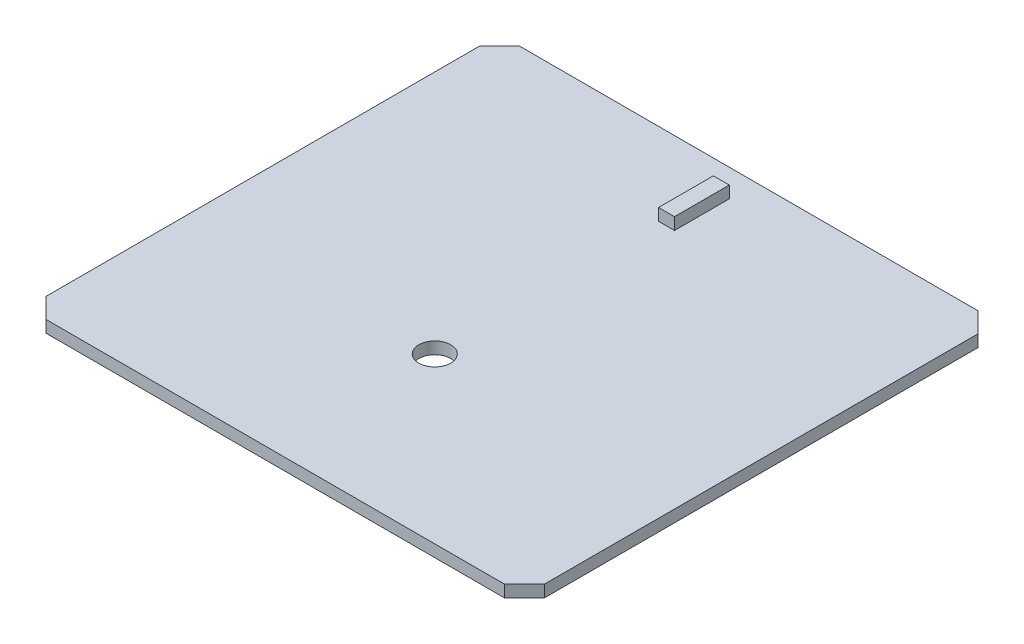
ISO-10303-21;
HEADER;
FILE_DESCRIPTION(('STEP AP214'),'2;1');
FILE_NAME('part.step','',(''),(''),'','','');
FILE_SCHEMA(('AUTOMOTIVE_DESIGN { 1 0 10303 214 1 1 1 1 }'));
ENDSEC;
DATA;
#1=APPLICATION_CONTEXT('core data for automotive mechanical design processes');
#2=APPLICATION_PROTOCOL_DEFINITION('international standard','automotive_design',2000,#1);
#3=PRODUCT_CONTEXT('',#1,'mechanical');
#4=PRODUCT('Part','Part','',(#3));
#5=PRODUCT_RELATED_PRODUCT_CATEGORY('part','',(#4));
#6=PRODUCT_DEFINITION_FORMATION('','',#4);
#7=PRODUCT_DEFINITION_CONTEXT('part definition',#1,'design');
#8=PRODUCT_DEFINITION('design','',#6,#7);
#9=PRODUCT_DEFINITION_SHAPE('','',#8);
#10=(LENGTH_UNIT() NAMED_UNIT(*) SI_UNIT(.MILLI.,.METRE.));
#11=(NAMED_UNIT(*) PLANE_ANGLE_UNIT() SI_UNIT($,.RADIAN.));
#12=(NAMED_UNIT(*) SI_UNIT($,.STERADIAN.) SOLID_ANGLE_UNIT());
#13=UNCERTAINTY_MEASURE_WITH_UNIT(LENGTH_MEASURE(1.E-05),#10,'distance_accuracy_value','');
#14=(GEOMETRIC_REPRESENTATION_CONTEXT(3) GLOBAL_UNCERTAINTY_ASSIGNED_CONTEXT((#13)) GLOBAL_UNIT_ASSIGNED_CONTEXT((#10,
#11,#12)) REPRESENTATION_CONTEXT('',''));
#15=CARTESIAN_POINT('',(0.,0.,0.));
#16=DIRECTION('',(0.,0.,1.));
#17=DIRECTION('',(1.,0.,0.));
#18=AXIS2_PLACEMENT_3D('',#15,#16,#17);
#19=CARTESIAN_POINT('',(0.,0.,0.));
#20=DIRECTION('',(0.,-1.,0.));
#21=DIRECTION('',(0.,0.,-1.));
#22=AXIS2_PLACEMENT_3D('',#19,#20,#21);
#23=PLANE('',#22);
#24=DIRECTION('',(-1.,0.,0.));
#25=VECTOR('',#24,1.);
#26=CARTESIAN_POINT('',(23.,0.,-23.75));
#27=LINE('',#26,#25);
#28=CARTESIAN_POINT('',(23.,0.,-23.75));
#29=VERTEX_POINT('',#28);
#30=CARTESIAN_POINT('',(-23.,0.,-23.75));
#31=VERTEX_POINT('',#30);
#32=EDGE_CURVE('E212',#29,#31,#27,.T.);
#33=ORIENTED_EDGE('',*,*,#32,.F.);
#34=DIRECTION('',(-0.707106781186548,0.,-0.707106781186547));
#35=VECTOR('',#34,1.);
#36=CARTESIAN_POINT('',(25.,0.,-21.75));
#37=LINE('',#36,#35);
#38=CARTESIAN_POINT('',(25.,0.,-21.75));
#39=VERTEX_POINT('',#38);
#40=EDGE_CURVE('E219',#39,#29,#37,.T.);
#41=ORIENTED_EDGE('',*,*,#40,.F.);
#42=DIRECTION('',(0.,0.,-1.));
#43=VECTOR('',#42,1.);
#44=CARTESIAN_POINT('',(25.,0.,21.75));
#45=LINE('',#44,#43);
#46=CARTESIAN_POINT('',(25.,0.,21.75));
#47=VERTEX_POINT('',#46);
#48=EDGE_CURVE('E246',#47,#39,#45,.T.);
#49=ORIENTED_EDGE('',*,*,#48,.F.);
#50=DIRECTION('',(0.707106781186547,0.,-0.707106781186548));
#51=VECTOR('',#50,1.);
#52=CARTESIAN_POINT('',(25.,0.,21.75));
#53=LINE('',#52,#51);
#54=CARTESIAN_POINT('',(23.,0.,23.75));
#55=VERTEX_POINT('',#54);
#56=EDGE_CURVE('E244',#55,#47,#53,.T.);
#57=ORIENTED_EDGE('',*,*,#56,.F.);
#58=DIRECTION('',(1.,0.,0.));
#59=VECTOR('',#58,1.);
#60=CARTESIAN_POINT('',(23.,0.,23.75));
#61=LINE('',#60,#59);
#62=CARTESIAN_POINT('',(-23.,0.,23.75));
#63=VERTEX_POINT('',#62);
#64=EDGE_CURVE('E242',#63,#55,#61,.T.);
#65=ORIENTED_EDGE('',*,*,#64,.F.);
#66=DIRECTION('',(0.707106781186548,0.,0.707106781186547));
#67=VECTOR('',#66,1.);
#68=CARTESIAN_POINT('',(-23.,0.,23.75));
#69=LINE('',#68,#67);
#70=CARTESIAN_POINT('',(-25.,0.,21.75));
#71=VERTEX_POINT('',#70);
#72=EDGE_CURVE('E240',#71,#63,#69,.T.);
#73=ORIENTED_EDGE('',*,*,#72,.F.);
#74=DIRECTION('',(0.,0.,1.));
#75=VECTOR('',#74,1.);
#76=CARTESIAN_POINT('',(-25.,0.,21.75));
#77=LINE('',#76,#75);
#78=CARTESIAN_POINT('',(-25.,0.,-21.75));
#79=VERTEX_POINT('',#78);
#80=EDGE_CURVE('E238',#79,#71,#77,.T.);
#81=ORIENTED_EDGE('',*,*,#80,.F.);
#82=DIRECTION('',(-0.707106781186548,0.,0.707106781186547));
#83=VECTOR('',#82,1.);
#84=CARTESIAN_POINT('',(-23.,0.,-23.75));
#85=LINE('',#84,#83);
#86=EDGE_CURVE('E236',#31,#79,#85,.T.);
#87=ORIENTED_EDGE('',*,*,#86,.F.);
#88=EDGE_LOOP('',(#33,#41,#49,#57,#65,#73,#81,#87));
#89=FACE_BOUND('',#88,.T.);
#90=CARTESIAN_POINT('',(-0.500000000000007,0.,7.25));
#91=DIRECTION('',(0.,1.,0.));
#92=DIRECTION('',(0.,0.,1.));
#93=AXIS2_PLACEMENT_3D('',#90,#91,#92);
#94=CIRCLE('',#93,1.6);
#95=CARTESIAN_POINT('',(-0.500000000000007,0.,8.85));
#96=VERTEX_POINT('',#95);
#97=EDGE_CURVE('E208',#96,#96,#94,.T.);
#98=ORIENTED_EDGE('',*,*,#97,.T.);
#99=EDGE_LOOP('',(#98));
#100=FACE_BOUND('',#99,.T.);
#101=DIRECTION('',(1.,0.,0.));
#102=VECTOR('',#101,1.);
#103=CARTESIAN_POINT('',(-8.50000000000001,0.,9.));
#104=LINE('',#103,#102);
#105=CARTESIAN_POINT('',(-15.5,0.,9.));
#106=VERTEX_POINT('',#105);
#107=CARTESIAN_POINT('',(-8.50000000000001,0.,9.));
#108=VERTEX_POINT('',#107);
#109=EDGE_CURVE('E497',#106,#108,#104,.T.);
#110=ORIENTED_EDGE('',*,*,#109,.F.);
#111=DIRECTION('',(0.,0.,-1.));
#112=VECTOR('',#111,1.);
#113=CARTESIAN_POINT('',(-15.5,0.,13.5));
#114=LINE('',#113,#112);
#115=CARTESIAN_POINT('',(-15.5,0.,13.5));
#116=VERTEX_POINT('',#115);
#117=EDGE_CURVE('E172',#116,#106,#114,.T.);
#118=ORIENTED_EDGE('',*,*,#117,.F.);
#119=DIRECTION('',(-1.,0.,0.));
#120=VECTOR('',#119,1.);
#121=CARTESIAN_POINT('',(-8.50000000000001,0.,13.5));
#122=LINE('',#121,#120);
#123=CARTESIAN_POINT('',(-8.50000000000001,0.,13.5));
#124=VERTEX_POINT('',#123);
#125=EDGE_CURVE('E168',#124,#116,#122,.T.);
#126=ORIENTED_EDGE('',*,*,#125,.F.);
#127=DIRECTION('',(0.,0.,1.));
#128=VECTOR('',#127,1.);
#129=CARTESIAN_POINT('',(-8.50000000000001,0.,13.5));
#130=LINE('',#129,#128);
#131=EDGE_CURVE('E494',#108,#124,#130,.T.);
#132=ORIENTED_EDGE('',*,*,#131,.F.);
#133=EDGE_LOOP('',(#110,#118,#126,#132));
#134=FACE_BOUND('',#133,.T.);
#135=ADVANCED_FACE('F36',(#89,#100,#134),#23,.T.);
#136=CARTESIAN_POINT('',(0.,1.2,0.));
#137=DIRECTION('',(0.,-1.,0.));
#138=DIRECTION('',(0.,0.,-1.));
#139=AXIS2_PLACEMENT_3D('',#136,#137,#138);
#140=PLANE('',#139);
#141=CARTESIAN_POINT('',(-0.500000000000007,1.2,7.25));
#142=DIRECTION('',(0.,1.,0.));
#143=DIRECTION('',(0.,0.,1.));
#144=AXIS2_PLACEMENT_3D('',#141,#142,#143);
#145=CIRCLE('',#144,1.6);
#146=CARTESIAN_POINT('',(-0.500000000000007,1.2,8.85));
#147=VERTEX_POINT('',#146);
#148=EDGE_CURVE('E209',#147,#147,#145,.T.);
#149=ORIENTED_EDGE('',*,*,#148,.F.);
#150=EDGE_LOOP('',(#149));
#151=FACE_BOUND('',#150,.T.);
#152=DIRECTION('',(-1.,0.,0.));
#153=VECTOR('',#152,1.);
#154=CARTESIAN_POINT('',(23.,1.2,-23.75));
#155=LINE('',#154,#153);
#156=CARTESIAN_POINT('',(23.,1.2,-23.75));
#157=VERTEX_POINT('',#156);
#158=CARTESIAN_POINT('',(-23.,1.2,-23.75));
#159=VERTEX_POINT('',#158);
#160=EDGE_CURVE('E215',#157,#159,#155,.T.);
#161=ORIENTED_EDGE('',*,*,#160,.T.);
#162=DIRECTION('',(-0.707106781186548,0.,0.707106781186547));
#163=VECTOR('',#162,1.);
#164=CARTESIAN_POINT('',(-23.,1.2,-23.75));
#165=LINE('',#164,#163);
#166=CARTESIAN_POINT('',(-25.,1.2,-21.75));
#167=VERTEX_POINT('',#166);
#168=EDGE_CURVE('E218',#159,#167,#165,.T.);
#169=ORIENTED_EDGE('',*,*,#168,.T.);
#170=DIRECTION('',(0.,0.,1.));
#171=VECTOR('',#170,1.);
#172=CARTESIAN_POINT('',(-25.,1.2,21.75));
#173=LINE('',#172,#171);
#174=CARTESIAN_POINT('',(-25.,1.2,21.75));
#175=VERTEX_POINT('',#174);
#176=EDGE_CURVE('E221',#167,#175,#173,.T.);
#177=ORIENTED_EDGE('',*,*,#176,.T.);
#178=DIRECTION('',(0.707106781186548,0.,0.707106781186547));
#179=VECTOR('',#178,1.);
#180=CARTESIAN_POINT('',(-23.,1.2,23.75));
#181=LINE('',#180,#179);
#182=CARTESIAN_POINT('',(-23.,1.2,23.75));
#183=VERTEX_POINT('',#182);
#184=EDGE_CURVE('E223',#175,#183,#181,.T.);
#185=ORIENTED_EDGE('',*,*,#184,.T.);
#186=DIRECTION('',(1.,0.,0.));
#187=VECTOR('',#186,1.);
#188=CARTESIAN_POINT('',(23.,1.2,23.75));
#189=LINE('',#188,#187);
#190=CARTESIAN_POINT('',(23.,1.2,23.75));
#191=VERTEX_POINT('',#190);
#192=EDGE_CURVE('E225',#183,#191,#189,.T.);
#193=ORIENTED_EDGE('',*,*,#192,.T.);
#194=DIRECTION('',(0.707106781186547,0.,-0.707106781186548));
#195=VECTOR('',#194,1.);
#196=CARTESIAN_POINT('',(25.,1.2,21.75));
#197=LINE('',#196,#195);
#198=CARTESIAN_POINT('',(25.,1.2,21.75));
#199=VERTEX_POINT('',#198);
#200=EDGE_CURVE('E227',#191,#199,#197,.T.);
#201=ORIENTED_EDGE('',*,*,#200,.T.);
#202=DIRECTION('',(0.,0.,-1.));
#203=VECTOR('',#202,1.);
#204=CARTESIAN_POINT('',(25.,1.2,21.75));
#205=LINE('',#204,#203);
#206=CARTESIAN_POINT('',(25.,1.2,-21.75));
#207=VERTEX_POINT('',#206);
#208=EDGE_CURVE('E229',#199,#207,#205,.T.);
#209=ORIENTED_EDGE('',*,*,#208,.T.);
#210=DIRECTION('',(-0.707106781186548,0.,-0.707106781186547));
#211=VECTOR('',#210,1.);
#212=CARTESIAN_POINT('',(25.,1.2,-21.75));
#213=LINE('',#212,#211);
#214=EDGE_CURVE('E231',#207,#157,#213,.T.);
#215=ORIENTED_EDGE('',*,*,#214,.T.);
#216=EDGE_LOOP('',(#161,#169,#177,#185,#193,#201,#209,#215));
#217=FACE_BOUND('',#216,.T.);
#218=DIRECTION('',(0.,0.,-1.));
#219=VECTOR('',#218,1.);
#220=CARTESIAN_POINT('',(0.799999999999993,1.2,-15.5));
#221=LINE('',#220,#219);
#222=CARTESIAN_POINT('',(0.799999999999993,1.2,-15.5));
#223=VERTEX_POINT('',#222);
#224=CARTESIAN_POINT('',(0.799999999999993,1.2,-21.));
#225=VERTEX_POINT('',#224);
#226=EDGE_CURVE('E174',#223,#225,#221,.T.);
#227=ORIENTED_EDGE('',*,*,#226,.F.);
#228=DIRECTION('',(1.,0.,0.));
#229=VECTOR('',#228,1.);
#230=CARTESIAN_POINT('',(-0.800000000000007,1.2,-15.5));
#231=LINE('',#230,#229);
#232=CARTESIAN_POINT('',(-0.800000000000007,1.2,-15.5));
#233=VERTEX_POINT('',#232);
#234=EDGE_CURVE('E185',#233,#223,#231,.T.);
#235=ORIENTED_EDGE('',*,*,#234,.F.);
#236=DIRECTION('',(0.,0.,1.));
#237=VECTOR('',#236,1.);
#238=CARTESIAN_POINT('',(-0.800000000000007,1.2,-15.5));
#239=LINE('',#238,#237);
#240=CARTESIAN_POINT('',(-0.800000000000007,1.2,-21.));
#241=VERTEX_POINT('',#240);
#242=EDGE_CURVE('E193',#241,#233,#239,.T.);
#243=ORIENTED_EDGE('',*,*,#242,.F.);
#244=DIRECTION('',(-1.,0.,0.));
#245=VECTOR('',#244,1.);
#246=CARTESIAN_POINT('',(-0.800000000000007,1.2,-21.));
#247=LINE('',#246,#245);
#248=EDGE_CURVE('E59',#225,#241,#247,.T.);
#249=ORIENTED_EDGE('',*,*,#248,.F.);
#250=EDGE_LOOP('',(#227,#235,#243,#249));
#251=FACE_BOUND('',#250,.T.);
#252=ADVANCED_FACE('F289',(#151,#217,#251),#140,.F.);
#253=CARTESIAN_POINT('',(23.,1.2,-23.75));
#254=DIRECTION('',(0.,0.,1.));
#255=DIRECTION('',(1.,0.,0.));
#256=AXIS2_PLACEMENT_3D('',#253,#254,#255);
#257=PLANE('',#256);
#258=ORIENTED_EDGE('',*,*,#32,.T.);
#259=DIRECTION('',(0.,-1.,0.));
#260=VECTOR('',#259,1.);
#261=CARTESIAN_POINT('',(-23.,1.2,-23.75));
#262=LINE('',#261,#260);
#263=EDGE_CURVE('E11',#159,#31,#262,.T.);
#264=ORIENTED_EDGE('',*,*,#263,.F.);
#265=ORIENTED_EDGE('',*,*,#160,.F.);
#266=DIRECTION('',(0.,-1.,0.));
#267=VECTOR('',#266,1.);
#268=CARTESIAN_POINT('',(23.,1.2,-23.75));
#269=LINE('',#268,#267);
#270=EDGE_CURVE('E233',#157,#29,#269,.T.);
#271=ORIENTED_EDGE('',*,*,#270,.T.);
#272=EDGE_LOOP('',(#258,#264,#265,#271));
#273=FACE_BOUND('',#272,.T.);
#274=ADVANCED_FACE('F38',(#273),#257,.F.);
#275=CARTESIAN_POINT('',(-23.,1.2,-23.75));
#276=DIRECTION('',(0.707106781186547,0.,0.707106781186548));
#277=DIRECTION('',(0.707106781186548,0.,-0.707106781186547));
#278=AXIS2_PLACEMENT_3D('',#275,#276,#277);
#279=PLANE('',#278);
#280=ORIENTED_EDGE('',*,*,#86,.T.);
#281=DIRECTION('',(0.,-1.,0.));
#282=VECTOR('',#281,1.);
#283=CARTESIAN_POINT('',(-25.,1.2,-21.75));
#284=LINE('',#283,#282);
#285=EDGE_CURVE('E44',#167,#79,#284,.T.);
#286=ORIENTED_EDGE('',*,*,#285,.F.);
#287=ORIENTED_EDGE('',*,*,#168,.F.);
#288=ORIENTED_EDGE('',*,*,#263,.T.);
#289=EDGE_LOOP('',(#280,#286,#287,#288));
#290=FACE_BOUND('',#289,.T.);
#291=ADVANCED_FACE('F293',(#290),#279,.F.);
#292=CARTESIAN_POINT('',(-25.,1.2,21.75));
#293=DIRECTION('',(1.,0.,0.));
#294=DIRECTION('',(0.,0.,-1.));
#295=AXIS2_PLACEMENT_3D('',#292,#293,#294);
#296=PLANE('',#295);
#297=ORIENTED_EDGE('',*,*,#80,.T.);
#298=DIRECTION('',(0.,-1.,0.));
#299=VECTOR('',#298,1.);
#300=CARTESIAN_POINT('',(-25.,1.2,21.75));
#301=LINE('',#300,#299);
#302=EDGE_CURVE('E263',#175,#71,#301,.T.);
#303=ORIENTED_EDGE('',*,*,#302,.F.);
#304=ORIENTED_EDGE('',*,*,#176,.F.);
#305=ORIENTED_EDGE('',*,*,#285,.T.);
#306=EDGE_LOOP('',(#297,#303,#304,#305));
#307=FACE_BOUND('',#306,.T.);
#308=ADVANCED_FACE('F270',(#307),#296,.F.);
#309=CARTESIAN_POINT('',(-23.,1.2,23.75));
#310=DIRECTION('',(0.707106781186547,0.,-0.707106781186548));
#311=DIRECTION('',(-0.707106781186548,0.,-0.707106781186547));
#312=AXIS2_PLACEMENT_3D('',#309,#310,#311);
#313=PLANE('',#312);
#314=ORIENTED_EDGE('',*,*,#72,.T.);
#315=DIRECTION('',(0.,-1.,0.));
#316=VECTOR('',#315,1.);
#317=CARTESIAN_POINT('',(-23.,1.2,23.75));
#318=LINE('',#317,#316);
#319=EDGE_CURVE('E260',#183,#63,#318,.T.);
#320=ORIENTED_EDGE('',*,*,#319,.F.);
#321=ORIENTED_EDGE('',*,*,#184,.F.);
#322=ORIENTED_EDGE('',*,*,#302,.T.);
#323=EDGE_LOOP('',(#314,#320,#321,#322));
#324=FACE_BOUND('',#323,.T.);
#325=ADVANCED_FACE('F281',(#324),#313,.F.);
#326=CARTESIAN_POINT('',(23.,1.2,23.75));
#327=DIRECTION('',(0.,0.,-1.));
#328=DIRECTION('',(-1.,0.,0.));
#329=AXIS2_PLACEMENT_3D('',#326,#327,#328);
#330=PLANE('',#329);
#331=ORIENTED_EDGE('',*,*,#64,.T.);
#332=DIRECTION('',(0.,-1.,0.));
#333=VECTOR('',#332,1.);
#334=CARTESIAN_POINT('',(23.,1.2,23.75));
#335=LINE('',#334,#333);
#336=EDGE_CURVE('E257',#191,#55,#335,.T.);
#337=ORIENTED_EDGE('',*,*,#336,.F.);
#338=ORIENTED_EDGE('',*,*,#192,.F.);
#339=ORIENTED_EDGE('',*,*,#319,.T.);
#340=EDGE_LOOP('',(#331,#337,#338,#339));
#341=FACE_BOUND('',#340,.T.);
#342=ADVANCED_FACE('F285',(#341),#330,.F.);
#343=CARTESIAN_POINT('',(25.,1.2,21.75));
#344=DIRECTION('',(-0.707106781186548,0.,-0.707106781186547));
#345=DIRECTION('',(-0.707106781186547,0.,0.707106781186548));
#346=AXIS2_PLACEMENT_3D('',#343,#344,#345);
#347=PLANE('',#346);
#348=ORIENTED_EDGE('',*,*,#56,.T.);
#349=DIRECTION('',(0.,-1.,0.));
#350=VECTOR('',#349,1.);
#351=CARTESIAN_POINT('',(25.,1.2,21.75));
#352=LINE('',#351,#350);
#353=EDGE_CURVE('E254',#199,#47,#352,.T.);
#354=ORIENTED_EDGE('',*,*,#353,.F.);
#355=ORIENTED_EDGE('',*,*,#200,.F.);
#356=ORIENTED_EDGE('',*,*,#336,.T.);
#357=EDGE_LOOP('',(#348,#354,#355,#356));
#358=FACE_BOUND('',#357,.T.);
#359=ADVANCED_FACE('F306',(#358),#347,.F.);
#360=CARTESIAN_POINT('',(25.,1.2,21.75));
#361=DIRECTION('',(-1.,0.,0.));
#362=DIRECTION('',(0.,0.,1.));
#363=AXIS2_PLACEMENT_3D('',#360,#361,#362);
#364=PLANE('',#363);
#365=ORIENTED_EDGE('',*,*,#48,.T.);
#366=DIRECTION('',(0.,-1.,0.));
#367=VECTOR('',#366,1.);
#368=CARTESIAN_POINT('',(25.,1.2,-21.75));
#369=LINE('',#368,#367);
#370=EDGE_CURVE('E251',#207,#39,#369,.T.);
#371=ORIENTED_EDGE('',*,*,#370,.F.);
#372=ORIENTED_EDGE('',*,*,#208,.F.);
#373=ORIENTED_EDGE('',*,*,#353,.T.);
#374=EDGE_LOOP('',(#365,#371,#372,#373));
#375=FACE_BOUND('',#374,.T.);
#376=ADVANCED_FACE('F304',(#375),#364,.F.);
#377=CARTESIAN_POINT('',(25.,1.2,-21.75));
#378=DIRECTION('',(-0.707106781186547,0.,0.707106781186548));
#379=DIRECTION('',(0.707106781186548,0.,0.707106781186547));
#380=AXIS2_PLACEMENT_3D('',#377,#378,#379);
#381=PLANE('',#380);
#382=ORIENTED_EDGE('',*,*,#40,.T.);
#383=ORIENTED_EDGE('',*,*,#270,.F.);
#384=ORIENTED_EDGE('',*,*,#214,.F.);
#385=ORIENTED_EDGE('',*,*,#370,.T.);
#386=EDGE_LOOP('',(#382,#383,#384,#385));
#387=FACE_BOUND('',#386,.T.);
#388=ADVANCED_FACE('F299',(#387),#381,.F.);
#389=CARTESIAN_POINT('',(-0.500000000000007,1.2,7.25));
#390=DIRECTION('',(0.,-1.,0.));
#391=DIRECTION('',(0.,0.,-1.));
#392=AXIS2_PLACEMENT_3D('',#389,#390,#391);
#393=CYLINDRICAL_SURFACE('',#392,1.6);
#394=ORIENTED_EDGE('',*,*,#148,.T.);
#395=EDGE_LOOP('',(#394));
#396=FACE_BOUND('',#395,.T.);
#397=ORIENTED_EDGE('',*,*,#97,.F.);
#398=EDGE_LOOP('',(#397));
#399=FACE_BOUND('',#398,.T.);
#400=ADVANCED_FACE('F325',(#396,#399),#393,.F.);
#401=CARTESIAN_POINT('',(0.799999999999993,2.4,-15.5));
#402=DIRECTION('',(-1.,0.,0.));
#403=DIRECTION('',(0.,0.,1.));
#404=AXIS2_PLACEMENT_3D('',#401,#402,#403);
#405=PLANE('',#404);
#406=ORIENTED_EDGE('',*,*,#226,.T.);
#407=DIRECTION('',(0.,-1.,0.));
#408=VECTOR('',#407,1.);
#409=CARTESIAN_POINT('',(0.799999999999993,2.4,-21.));
#410=LINE('',#409,#408);
#411=CARTESIAN_POINT('',(0.799999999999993,2.4,-21.));
#412=VERTEX_POINT('',#411);
#413=EDGE_CURVE('E206',#412,#225,#410,.T.);
#414=ORIENTED_EDGE('',*,*,#413,.F.);
#415=DIRECTION('',(0.,0.,-1.));
#416=VECTOR('',#415,1.);
#417=CARTESIAN_POINT('',(0.799999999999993,2.4,-15.5));
#418=LINE('',#417,#416);
#419=CARTESIAN_POINT('',(0.799999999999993,2.4,-15.5));
#420=VERTEX_POINT('',#419);
#421=EDGE_CURVE('E181',#420,#412,#418,.T.);
#422=ORIENTED_EDGE('',*,*,#421,.F.);
#423=DIRECTION('',(0.,-1.,0.));
#424=VECTOR('',#423,1.);
#425=CARTESIAN_POINT('',(0.799999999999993,2.4,-15.5));
#426=LINE('',#425,#424);
#427=EDGE_CURVE('E190',#420,#223,#426,.T.);
#428=ORIENTED_EDGE('',*,*,#427,.T.);
#429=EDGE_LOOP('',(#406,#414,#422,#428));
#430=FACE_BOUND('',#429,.T.);
#431=ADVANCED_FACE('F329',(#430),#405,.F.);
#432=CARTESIAN_POINT('',(-0.800000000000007,2.4,-21.));
#433=DIRECTION('',(0.,0.,1.));
#434=DIRECTION('',(1.,0.,0.));
#435=AXIS2_PLACEMENT_3D('',#432,#433,#434);
#436=PLANE('',#435);
#437=ORIENTED_EDGE('',*,*,#248,.T.);
#438=DIRECTION('',(0.,-1.,0.));
#439=VECTOR('',#438,1.);
#440=CARTESIAN_POINT('',(-0.800000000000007,2.4,-21.));
#441=LINE('',#440,#439);
#442=CARTESIAN_POINT('',(-0.800000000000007,2.4,-21.));
#443=VERTEX_POINT('',#442);
#444=EDGE_CURVE('E203',#443,#241,#441,.T.);
#445=ORIENTED_EDGE('',*,*,#444,.F.);
#446=DIRECTION('',(-1.,0.,0.));
#447=VECTOR('',#446,1.);
#448=CARTESIAN_POINT('',(-0.800000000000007,2.4,-21.));
#449=LINE('',#448,#447);
#450=EDGE_CURVE('E184',#412,#443,#449,.T.);
#451=ORIENTED_EDGE('',*,*,#450,.F.);
#452=ORIENTED_EDGE('',*,*,#413,.T.);
#453=EDGE_LOOP('',(#437,#445,#451,#452));
#454=FACE_BOUND('',#453,.T.);
#455=ADVANCED_FACE('F334',(#454),#436,.F.);
#456=CARTESIAN_POINT('',(-0.800000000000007,2.4,-15.5));
#457=DIRECTION('',(1.,0.,0.));
#458=DIRECTION('',(0.,0.,-1.));
#459=AXIS2_PLACEMENT_3D('',#456,#457,#458);
#460=PLANE('',#459);
#461=ORIENTED_EDGE('',*,*,#242,.T.);
#462=DIRECTION('',(0.,-1.,0.));
#463=VECTOR('',#462,1.);
#464=CARTESIAN_POINT('',(-0.800000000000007,2.4,-15.5));
#465=LINE('',#464,#463);
#466=CARTESIAN_POINT('',(-0.800000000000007,2.4,-15.5));
#467=VERTEX_POINT('',#466);
#468=EDGE_CURVE('E200',#467,#233,#465,.T.);
#469=ORIENTED_EDGE('',*,*,#468,.F.);
#470=DIRECTION('',(0.,0.,1.));
#471=VECTOR('',#470,1.);
#472=CARTESIAN_POINT('',(-0.800000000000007,2.4,-15.5));
#473=LINE('',#472,#471);
#474=EDGE_CURVE('E187',#443,#467,#473,.T.);
#475=ORIENTED_EDGE('',*,*,#474,.F.);
#476=ORIENTED_EDGE('',*,*,#444,.T.);
#477=EDGE_LOOP('',(#461,#469,#475,#476));
#478=FACE_BOUND('',#477,.T.);
#479=ADVANCED_FACE('F341',(#478),#460,.F.);
#480=CARTESIAN_POINT('',(-0.800000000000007,2.4,-15.5));
#481=DIRECTION('',(0.,0.,-1.));
#482=DIRECTION('',(-1.,0.,0.));
#483=AXIS2_PLACEMENT_3D('',#480,#481,#482);
#484=PLANE('',#483);
#485=ORIENTED_EDGE('',*,*,#234,.T.);
#486=ORIENTED_EDGE('',*,*,#427,.F.);
#487=DIRECTION('',(1.,0.,0.));
#488=VECTOR('',#487,1.);
#489=CARTESIAN_POINT('',(-0.800000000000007,2.4,-15.5));
#490=LINE('',#489,#488);
#491=EDGE_CURVE('E189',#467,#420,#490,.T.);
#492=ORIENTED_EDGE('',*,*,#491,.F.);
#493=ORIENTED_EDGE('',*,*,#468,.T.);
#494=EDGE_LOOP('',(#485,#486,#492,#493));
#495=FACE_BOUND('',#494,.T.);
#496=ADVANCED_FACE('F345',(#495),#484,.F.);
#497=CARTESIAN_POINT('',(0.,2.4,0.));
#498=DIRECTION('',(0.,-1.,0.));
#499=DIRECTION('',(0.,0.,-1.));
#500=AXIS2_PLACEMENT_3D('',#497,#498,#499);
#501=PLANE('',#500);
#502=ORIENTED_EDGE('',*,*,#421,.T.);
#503=ORIENTED_EDGE('',*,*,#450,.T.);
#504=ORIENTED_EDGE('',*,*,#474,.T.);
#505=ORIENTED_EDGE('',*,*,#491,.T.);
#506=EDGE_LOOP('',(#502,#503,#504,#505));
#507=FACE_BOUND('',#506,.T.);
#508=ADVANCED_FACE('F349',(#507),#501,.F.);
#509=CARTESIAN_POINT('',(-15.5,-3.,13.5));
#510=DIRECTION('',(1.,0.,0.));
#511=DIRECTION('',(0.,0.,-1.));
#512=AXIS2_PLACEMENT_3D('',#509,#510,#511);
#513=PLANE('',#512);
#514=ORIENTED_EDGE('',*,*,#117,.T.);
#515=DIRECTION('',(0.,1.,0.));
#516=VECTOR('',#515,1.);
#517=CARTESIAN_POINT('',(-15.5,-3.,9.));
#518=LINE('',#517,#516);
#519=CARTESIAN_POINT('',(-15.5,-3.,9.));
#520=VERTEX_POINT('',#519);
#521=EDGE_CURVE('E153',#520,#106,#518,.T.);
#522=ORIENTED_EDGE('',*,*,#521,.F.);
#523=DIRECTION('',(0.,0.,-1.));
#524=VECTOR('',#523,1.);
#525=CARTESIAN_POINT('',(-15.5,-3.,13.5));
#526=LINE('',#525,#524);
#527=CARTESIAN_POINT('',(-15.5,-3.,13.5));
#528=VERTEX_POINT('',#527);
#529=EDGE_CURVE('E160',#528,#520,#526,.T.);
#530=ORIENTED_EDGE('',*,*,#529,.F.);
#531=DIRECTION('',(0.,1.,0.));
#532=VECTOR('',#531,1.);
#533=CARTESIAN_POINT('',(-15.5,-3.,13.5));
#534=LINE('',#533,#532);
#535=EDGE_CURVE('E491',#528,#116,#534,.T.);
#536=ORIENTED_EDGE('',*,*,#535,.T.);
#537=EDGE_LOOP('',(#514,#522,#530,#536));
#538=FACE_BOUND('',#537,.T.);
#539=ADVANCED_FACE('F170',(#538),#513,.F.);
#540=CARTESIAN_POINT('',(-8.50000000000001,-3.,9.));
#541=DIRECTION('',(0.,0.,1.));
#542=DIRECTION('',(1.,0.,0.));
#543=AXIS2_PLACEMENT_3D('',#540,#541,#542);
#544=PLANE('',#543);
#545=ORIENTED_EDGE('',*,*,#109,.T.);
#546=DIRECTION('',(0.,1.,0.));
#547=VECTOR('',#546,1.);
#548=CARTESIAN_POINT('',(-8.50000000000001,-3.,9.));
#549=LINE('',#548,#547);
#550=CARTESIAN_POINT('',(-8.50000000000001,-3.,9.));
#551=VERTEX_POINT('',#550);
#552=EDGE_CURVE('E156',#551,#108,#549,.T.);
#553=ORIENTED_EDGE('',*,*,#552,.F.);
#554=DIRECTION('',(1.,0.,0.));
#555=VECTOR('',#554,1.);
#556=CARTESIAN_POINT('',(-8.50000000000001,-3.,9.));
#557=LINE('',#556,#555);
#558=EDGE_CURVE('E149',#520,#551,#557,.T.);
#559=ORIENTED_EDGE('',*,*,#558,.F.);
#560=ORIENTED_EDGE('',*,*,#521,.T.);
#561=EDGE_LOOP('',(#545,#553,#559,#560));
#562=FACE_BOUND('',#561,.T.);
#563=ADVANCED_FACE('F151',(#562),#544,.F.);
#564=CARTESIAN_POINT('',(-8.50000000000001,-3.,13.5));
#565=DIRECTION('',(-1.,0.,0.));
#566=DIRECTION('',(0.,0.,1.));
#567=AXIS2_PLACEMENT_3D('',#564,#565,#566);
#568=PLANE('',#567);
#569=ORIENTED_EDGE('',*,*,#131,.T.);
#570=DIRECTION('',(0.,1.,0.));
#571=VECTOR('',#570,1.);
#572=CARTESIAN_POINT('',(-8.50000000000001,-3.,13.5));
#573=LINE('',#572,#571);
#574=CARTESIAN_POINT('',(-8.50000000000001,-3.,13.5));
#575=VERTEX_POINT('',#574);
#576=EDGE_CURVE('E51',#575,#124,#573,.T.);
#577=ORIENTED_EDGE('',*,*,#576,.F.);
#578=DIRECTION('',(0.,0.,1.));
#579=VECTOR('',#578,1.);
#580=CARTESIAN_POINT('',(-8.50000000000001,-3.,13.5));
#581=LINE('',#580,#579);
#582=EDGE_CURVE('E159',#551,#575,#581,.T.);
#583=ORIENTED_EDGE('',*,*,#582,.F.);
#584=ORIENTED_EDGE('',*,*,#552,.T.);
#585=EDGE_LOOP('',(#569,#577,#583,#584));
#586=FACE_BOUND('',#585,.T.);
#587=ADVANCED_FACE('F358',(#586),#568,.F.);
#588=CARTESIAN_POINT('',(-8.50000000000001,-3.,13.5));
#589=DIRECTION('',(0.,0.,-1.));
#590=DIRECTION('',(-1.,0.,0.));
#591=AXIS2_PLACEMENT_3D('',#588,#589,#590);
#592=PLANE('',#591);
#593=ORIENTED_EDGE('',*,*,#125,.T.);
#594=ORIENTED_EDGE('',*,*,#535,.F.);
#595=DIRECTION('',(-1.,0.,0.));
#596=VECTOR('',#595,1.);
#597=CARTESIAN_POINT('',(-8.50000000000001,-3.,13.5));
#598=LINE('',#597,#596);
#599=EDGE_CURVE('E164',#575,#528,#598,.T.);
#600=ORIENTED_EDGE('',*,*,#599,.F.);
#601=ORIENTED_EDGE('',*,*,#576,.T.);
#602=EDGE_LOOP('',(#593,#594,#600,#601));
#603=FACE_BOUND('',#602,.T.);
#604=ADVANCED_FACE('F361',(#603),#592,.F.);
#605=CARTESIAN_POINT('',(0.,-3.,0.));
#606=DIRECTION('',(0.,1.,0.));
#607=DIRECTION('',(0.,0.,1.));
#608=AXIS2_PLACEMENT_3D('',#605,#606,#607);
#609=PLANE('',#608);
#610=ORIENTED_EDGE('',*,*,#529,.T.);
#611=ORIENTED_EDGE('',*,*,#558,.T.);
#612=ORIENTED_EDGE('',*,*,#582,.T.);
#613=ORIENTED_EDGE('',*,*,#599,.T.);
#614=EDGE_LOOP('',(#610,#611,#612,#613));
#615=FACE_BOUND('',#614,.T.);
#616=ADVANCED_FACE('F163',(#615),#609,.F.);
#617=CLOSED_SHELL('',(#135,#252,#274,#291,#308,#325,#342,#359,#376,#388,#400,#431,#455,#479,
#496,#508,#539,#563,#587,#604,#616));
#618=MANIFOLD_SOLID_BREP('B2',#617);
#619=ADVANCED_BREP_SHAPE_REPRESENTATION('',(#18,#618),#14);
#620=SHAPE_DEFINITION_REPRESENTATION(#9,#619);
ENDSEC;
END-ISO-10303-21;
